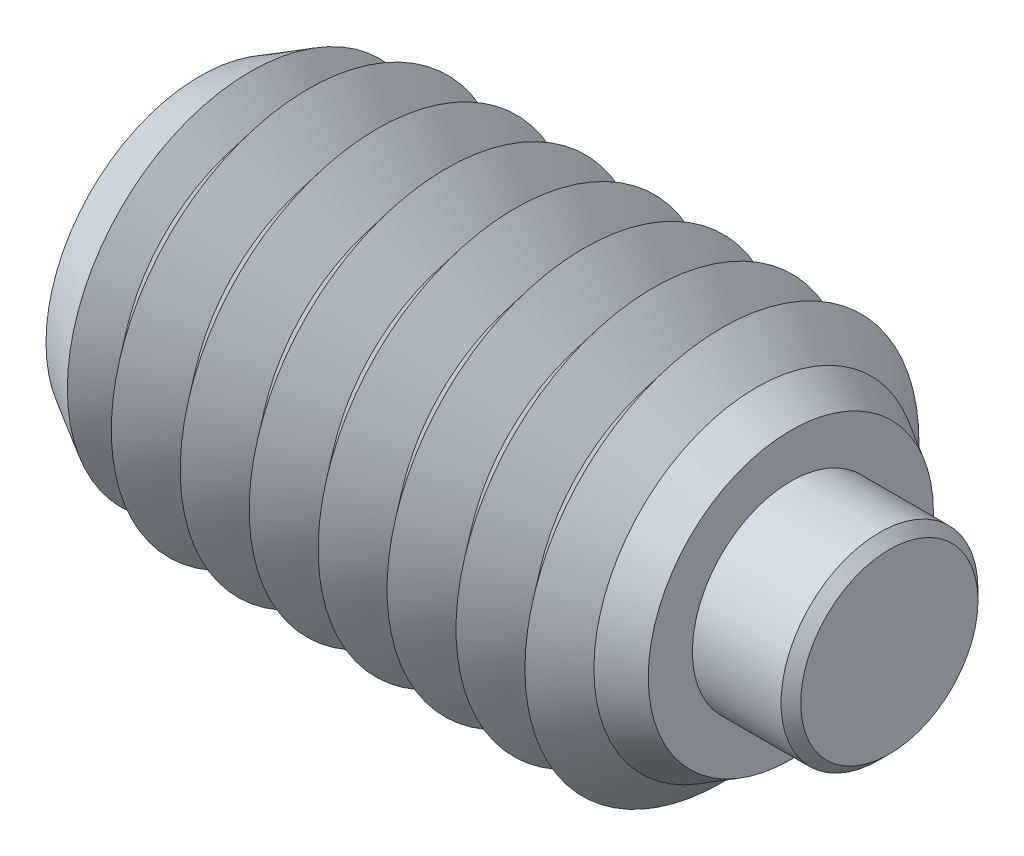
ISO-10303-21;
HEADER;
FILE_DESCRIPTION(('STEP AP214'),'2;1');
FILE_NAME('part.step','',(''),(''),'','','');
FILE_SCHEMA(('AUTOMOTIVE_DESIGN { 1 0 10303 214 1 1 1 1 }'));
ENDSEC;
DATA;
#1=APPLICATION_CONTEXT('core data for automotive mechanical design processes');
#2=APPLICATION_PROTOCOL_DEFINITION('international standard','automotive_design',2000,#1);
#3=PRODUCT_CONTEXT('',#1,'mechanical');
#4=PRODUCT('Part','Part','',(#3));
#5=PRODUCT_RELATED_PRODUCT_CATEGORY('part','',(#4));
#6=PRODUCT_DEFINITION_FORMATION('','',#4);
#7=PRODUCT_DEFINITION_CONTEXT('part definition',#1,'design');
#8=PRODUCT_DEFINITION('design','',#6,#7);
#9=PRODUCT_DEFINITION_SHAPE('','',#8);
#10=(LENGTH_UNIT() NAMED_UNIT(*) SI_UNIT(.MILLI.,.METRE.));
#11=(NAMED_UNIT(*) PLANE_ANGLE_UNIT() SI_UNIT($,.RADIAN.));
#12=(NAMED_UNIT(*) SI_UNIT($,.STERADIAN.) SOLID_ANGLE_UNIT());
#13=UNCERTAINTY_MEASURE_WITH_UNIT(LENGTH_MEASURE(1.E-05),#10,'distance_accuracy_value','');
#14=(GEOMETRIC_REPRESENTATION_CONTEXT(3) GLOBAL_UNCERTAINTY_ASSIGNED_CONTEXT((#13)) GLOBAL_UNIT_ASSIGNED_CONTEXT((#10,
#11,#12)) REPRESENTATION_CONTEXT('',''));
#15=CARTESIAN_POINT('',(0.,0.,0.));
#16=DIRECTION('',(0.,0.,1.));
#17=DIRECTION('',(1.,0.,0.));
#18=AXIS2_PLACEMENT_3D('',#15,#16,#17);
#19=CARTESIAN_POINT('',(1.35,0.,0.));
#20=DIRECTION('',(-1.,0.,0.));
#21=DIRECTION('',(0.,0.,1.));
#22=AXIS2_PLACEMENT_3D('',#19,#20,#21);
#23=CYLINDRICAL_SURFACE('',#22,1.);
#24=CARTESIAN_POINT('',(1.25,0.,0.));
#25=DIRECTION('',(1.,0.,0.));
#26=DIRECTION('',(0.,0.,-1.));
#27=AXIS2_PLACEMENT_3D('',#24,#25,#26);
#28=CIRCLE('',#27,1.);
#29=CARTESIAN_POINT('',(1.25,0.,-1.));
#30=VERTEX_POINT('',#29);
#31=EDGE_CURVE('P0_E10',#30,#30,#28,.F.);
#32=ORIENTED_EDGE('',*,*,#31,.T.);
#33=EDGE_LOOP('',(#32));
#34=FACE_BOUND('',#33,.T.);
#35=CARTESIAN_POINT('',(-0.65,0.,0.));
#36=DIRECTION('',(1.,0.,0.));
#37=DIRECTION('',(0.,0.,-1.));
#38=AXIS2_PLACEMENT_3D('',#35,#36,#37);
#39=CIRCLE('',#38,1.);
#40=CARTESIAN_POINT('',(-0.65,0.,-1.));
#41=VERTEX_POINT('',#40);
#42=EDGE_CURVE('P0_E25',#41,#41,#39,.T.);
#43=ORIENTED_EDGE('',*,*,#42,.T.);
#44=EDGE_LOOP('',(#43));
#45=FACE_BOUND('',#44,.T.);
#46=ADVANCED_FACE('P0_F14',(#34,#45),#23,.T.);
#47=CARTESIAN_POINT('',(1.35,0.,0.));
#48=DIRECTION('',(1.,0.,0.));
#49=DIRECTION('',(0.,0.,-1.));
#50=AXIS2_PLACEMENT_3D('',#47,#48,#49);
#51=PLANE('',#50);
#52=CARTESIAN_POINT('',(1.35,0.,0.));
#53=DIRECTION('',(1.,0.,0.));
#54=DIRECTION('',(0.,0.,-1.));
#55=AXIS2_PLACEMENT_3D('',#52,#53,#54);
#56=CIRCLE('',#55,0.899999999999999);
#57=CARTESIAN_POINT('',(1.35,0.,-0.899999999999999));
#58=VERTEX_POINT('',#57);
#59=EDGE_CURVE('P0_E21',#58,#58,#56,.T.);
#60=ORIENTED_EDGE('',*,*,#59,.T.);
#61=EDGE_LOOP('',(#60));
#62=FACE_BOUND('',#61,.T.);
#63=ADVANCED_FACE('P0_F35',(#62),#51,.T.);
#64=CARTESIAN_POINT('',(-0.65,0.,0.));
#65=DIRECTION('',(1.,0.,0.));
#66=DIRECTION('',(0.,0.,-1.));
#67=AXIS2_PLACEMENT_3D('',#64,#65,#66);
#68=PLANE('',#67);
#69=ORIENTED_EDGE('',*,*,#42,.F.);
#70=EDGE_LOOP('',(#69));
#71=FACE_BOUND('',#70,.T.);
#72=ADVANCED_FACE('P0_F33',(#71),#68,.F.);
#73=CARTESIAN_POINT('',(1.35,0.,0.));
#74=DIRECTION('',(-1.,0.,0.));
#75=DIRECTION('',(0.,0.,1.));
#76=AXIS2_PLACEMENT_3D('',#73,#74,#75);
#77=CONICAL_SURFACE('',#76,0.899999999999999,0.785398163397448);
#78=ORIENTED_EDGE('',*,*,#31,.F.);
#79=EDGE_LOOP('',(#78));
#80=FACE_BOUND('',#79,.T.);
#81=ORIENTED_EDGE('',*,*,#59,.F.);
#82=EDGE_LOOP('',(#81));
#83=FACE_BOUND('',#82,.T.);
#84=ADVANCED_FACE('P0_F16',(#80,#83),#77,.T.);
#85=CLOSED_SHELL('',(#46,#63,#72,#84));
#86=MANIFOLD_SOLID_BREP('P0_B1',#85);
#87=CARTESIAN_POINT('',(-5.25,0.,0.));
#88=DIRECTION('',(-1.,0.,0.));
#89=DIRECTION('',(0.,0.,1.));
#90=AXIS2_PLACEMENT_3D('',#87,#88,#89);
#91=CONICAL_SURFACE('',#90,2.,0.895664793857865);
#92=CARTESIAN_POINT('',(-4.9,0.,0.));
#93=DIRECTION('',(1.,0.,0.));
#94=DIRECTION('',(0.,0.,-1.));
#95=AXIS2_PLACEMENT_3D('',#92,#93,#94);
#96=CIRCLE('',#95,1.56285014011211);
#97=CARTESIAN_POINT('',(-4.9,0.,-1.56285014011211));
#98=VERTEX_POINT('',#97);
#99=EDGE_CURVE('P1_E671',#98,#98,#96,.T.);
#100=ORIENTED_EDGE('',*,*,#99,.F.);
#101=EDGE_LOOP('',(#100));
#102=FACE_BOUND('',#101,.T.);
#103=CARTESIAN_POINT('',(-5.13709186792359,0.,0.));
#104=DIRECTION('',(1.,0.,0.));
#105=DIRECTION('',(0.,0.,-1.));
#106=AXIS2_PLACEMENT_3D('',#103,#104,#105);
#107=CIRCLE('',#106,1.85897778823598);
#108=CARTESIAN_POINT('',(-5.13709186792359,0.,-1.85897778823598));
#109=VERTEX_POINT('',#108);
#110=EDGE_CURVE('P1_E674',#109,#109,#107,.F.);
#111=ORIENTED_EDGE('',*,*,#110,.F.);
#112=EDGE_LOOP('',(#111));
#113=FACE_BOUND('',#112,.T.);
#114=ADVANCED_FACE('P1_F15',(#102,#113),#91,.T.);
#115=CARTESIAN_POINT('',(-0.7,0.,0.));
#116=DIRECTION('',(1.,0.,0.));
#117=DIRECTION('',(0.,0.,-1.));
#118=AXIS2_PLACEMENT_3D('',#115,#116,#117);
#119=CONICAL_SURFACE('',#118,1.56285014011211,0.895664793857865);
#120=CARTESIAN_POINT('',(-0.35,0.,0.));
#121=DIRECTION('',(1.,0.,0.));
#122=DIRECTION('',(0.,0.,-1.));
#123=AXIS2_PLACEMENT_3D('',#120,#121,#122);
#124=CIRCLE('',#123,2.);
#125=CARTESIAN_POINT('',(-0.35,0.,2.));
#126=VERTEX_POINT('',#125);
#127=EDGE_CURVE('P1_E631',#126,#126,#124,.T.);
#128=ORIENTED_EDGE('',*,*,#127,.F.);
#129=EDGE_LOOP('',(#128));
#130=FACE_BOUND('',#129,.T.);
#131=CARTESIAN_POINT('',(-0.7,0.,0.));
#132=DIRECTION('',(1.,0.,0.));
#133=DIRECTION('',(0.,0.,-1.));
#134=AXIS2_PLACEMENT_3D('',#131,#132,#133);
#135=CIRCLE('',#134,1.56285014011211);
#136=CARTESIAN_POINT('',(-0.7,0.,-1.56285014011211));
#137=VERTEX_POINT('',#136);
#138=EDGE_CURVE('P1_E632',#137,#137,#135,.T.);
#139=ORIENTED_EDGE('',*,*,#138,.T.);
#140=EDGE_LOOP('',(#139));
#141=FACE_BOUND('',#140,.T.);
#142=ADVANCED_FACE('P1_F222',(#130,#141),#119,.T.);
#143=CARTESIAN_POINT('',(-1.05,0.,0.));
#144=DIRECTION('',(-1.,0.,0.));
#145=DIRECTION('',(0.,0.,1.));
#146=AXIS2_PLACEMENT_3D('',#143,#144,#145);
#147=CONICAL_SURFACE('',#146,2.,0.895664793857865);
#148=ORIENTED_EDGE('',*,*,#138,.F.);
#149=EDGE_LOOP('',(#148));
#150=FACE_BOUND('',#149,.T.);
#151=CARTESIAN_POINT('',(-1.05,0.,0.));
#152=DIRECTION('',(1.,0.,0.));
#153=DIRECTION('',(0.,0.,-1.));
#154=AXIS2_PLACEMENT_3D('',#151,#152,#153);
#155=CIRCLE('',#154,2.);
#156=CARTESIAN_POINT('',(-1.05,0.,-2.));
#157=VERTEX_POINT('',#156);
#158=EDGE_CURVE('P1_E636',#157,#157,#155,.T.);
#159=ORIENTED_EDGE('',*,*,#158,.T.);
#160=EDGE_LOOP('',(#159));
#161=FACE_BOUND('',#160,.T.);
#162=ADVANCED_FACE('P1_F227',(#150,#161),#147,.T.);
#163=CARTESIAN_POINT('',(-0.65,0.,0.));
#164=DIRECTION('',(1.,0.,0.));
#165=DIRECTION('',(0.,1.,0.));
#166=AXIS2_PLACEMENT_3D('',#163,#164,#165);
#167=PLANE('',#166);
#168=CARTESIAN_POINT('',(-0.65,0.,0.));
#169=DIRECTION('',(1.,0.,0.));
#170=DIRECTION('',(0.,1.,0.));
#171=AXIS2_PLACEMENT_3D('',#168,#169,#170);
#172=CIRCLE('',#171,1.);
#173=CARTESIAN_POINT('',(-0.65,1.,0.));
#174=VERTEX_POINT('',#173);
#175=EDGE_CURVE('P1_E350',#174,#174,#172,.T.);
#176=ORIENTED_EDGE('',*,*,#175,.T.);
#177=EDGE_LOOP('',(#176));
#178=FACE_BOUND('',#177,.T.);
#179=ADVANCED_FACE('P1_F277',(#178),#167,.T.);
#180=CARTESIAN_POINT('',(-0.65,0.,0.));
#181=DIRECTION('',(1.,0.,0.));
#182=DIRECTION('',(0.,1.,0.));
#183=AXIS2_PLACEMENT_3D('',#180,#181,#182);
#184=CYLINDRICAL_SURFACE('',#183,1.);
#185=ORIENTED_EDGE('',*,*,#175,.F.);
#186=EDGE_LOOP('',(#185));
#187=FACE_BOUND('',#186,.T.);
#188=CARTESIAN_POINT('',(0.35,0.,0.));
#189=DIRECTION('',(1.,0.,0.));
#190=DIRECTION('',(0.,1.,0.));
#191=AXIS2_PLACEMENT_3D('',#188,#189,#190);
#192=CIRCLE('',#191,1.);
#193=CARTESIAN_POINT('',(0.35,1.,0.));
#194=VERTEX_POINT('',#193);
#195=EDGE_CURVE('P1_E353',#194,#194,#192,.T.);
#196=ORIENTED_EDGE('',*,*,#195,.T.);
#197=EDGE_LOOP('',(#196));
#198=FACE_BOUND('',#197,.T.);
#199=ADVANCED_FACE('P1_F209',(#187,#198),#184,.F.);
#200=CARTESIAN_POINT('',(0.35,1.44792740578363,0.));
#201=DIRECTION('',(1.,0.,0.));
#202=DIRECTION('',(0.,1.,0.));
#203=AXIS2_PLACEMENT_3D('',#200,#201,#202);
#204=PLANE('',#203);
#205=ORIENTED_EDGE('',*,*,#195,.F.);
#206=EDGE_LOOP('',(#205));
#207=FACE_BOUND('',#206,.T.);
#208=CARTESIAN_POINT('',(0.35,0.,0.));
#209=DIRECTION('',(1.,0.,0.));
#210=DIRECTION('',(0.,1.,0.));
#211=AXIS2_PLACEMENT_3D('',#208,#209,#210);
#212=CIRCLE('',#211,1.44792740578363);
#213=CARTESIAN_POINT('',(0.35,1.44792740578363,0.));
#214=VERTEX_POINT('',#213);
#215=EDGE_CURVE('P1_E121',#214,#214,#212,.T.);
#216=ORIENTED_EDGE('',*,*,#215,.T.);
#217=EDGE_LOOP('',(#216));
#218=FACE_BOUND('',#217,.T.);
#219=ADVANCED_FACE('P1_F206',(#207,#218),#204,.T.);
#220=CARTESIAN_POINT('',(0.35,0.,0.));
#221=DIRECTION('',(-1.,0.,0.));
#222=DIRECTION('',(0.,-1.,0.));
#223=AXIS2_PLACEMENT_3D('',#220,#221,#222);
#224=CONICAL_SURFACE('',#223,1.44792740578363,0.523598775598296);
#225=CARTESIAN_POINT('',(0.,0.,0.));
#226=DIRECTION('',(1.,0.,0.));
#227=DIRECTION('',(0.,0.,-1.));
#228=AXIS2_PLACEMENT_3D('',#225,#226,#227);
#229=CIRCLE('',#228,1.65);
#230=CARTESIAN_POINT('',(0.,0.,1.65));
#231=VERTEX_POINT('',#230);
#232=EDGE_CURVE('P1_E341',#231,#231,#229,.T.);
#233=ORIENTED_EDGE('',*,*,#232,.T.);
#234=EDGE_LOOP('',(#233));
#235=FACE_BOUND('',#234,.T.);
#236=ORIENTED_EDGE('',*,*,#215,.F.);
#237=EDGE_LOOP('',(#236));
#238=FACE_BOUND('',#237,.T.);
#239=ADVANCED_FACE('P1_F203',(#235,#238),#224,.T.);
#240=CARTESIAN_POINT('',(0.,0.,0.));
#241=DIRECTION('',(-1.,0.,0.));
#242=DIRECTION('',(0.,0.,1.));
#243=AXIS2_PLACEMENT_3D('',#240,#241,#242);
#244=CONICAL_SURFACE('',#243,1.65,0.785398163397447);
#245=CARTESIAN_POINT('',(-0.35,0.,2.));
#246=CARTESIAN_POINT('',(-0.346354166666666,0.,1.99635416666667));
#247=CARTESIAN_POINT('',(-0.342708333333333,0.,1.99270833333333));
#248=CARTESIAN_POINT('',(-0.335416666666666,0.,1.98541666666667));
#249=CARTESIAN_POINT('',(-0.331770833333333,0.,1.98177083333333));
#250=CARTESIAN_POINT('',(-0.324479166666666,0.,1.97447916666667));
#251=CARTESIAN_POINT('',(-0.320833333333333,0.,1.97083333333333));
#252=CARTESIAN_POINT('',(-0.313541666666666,0.,1.96354166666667));
#253=CARTESIAN_POINT('',(-0.309895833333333,0.,1.95989583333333));
#254=CARTESIAN_POINT('',(-0.302604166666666,0.,1.95260416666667));
#255=CARTESIAN_POINT('',(-0.298958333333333,0.,1.94895833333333));
#256=CARTESIAN_POINT('',(-0.291666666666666,0.,1.94166666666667));
#257=CARTESIAN_POINT('',(-0.288020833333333,0.,1.93802083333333));
#258=CARTESIAN_POINT('',(-0.280729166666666,0.,1.93072916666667));
#259=CARTESIAN_POINT('',(-0.277083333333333,0.,1.92708333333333));
#260=CARTESIAN_POINT('',(-0.269791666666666,0.,1.91979166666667));
#261=CARTESIAN_POINT('',(-0.266145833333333,0.,1.91614583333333));
#262=CARTESIAN_POINT('',(-0.258854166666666,0.,1.90885416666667));
#263=CARTESIAN_POINT('',(-0.255208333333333,0.,1.90520833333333));
#264=CARTESIAN_POINT('',(-0.247916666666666,0.,1.89791666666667));
#265=CARTESIAN_POINT('',(-0.244270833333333,0.,1.89427083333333));
#266=CARTESIAN_POINT('',(-0.236979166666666,0.,1.88697916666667));
#267=CARTESIAN_POINT('',(-0.233333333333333,0.,1.88333333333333));
#268=CARTESIAN_POINT('',(-0.226041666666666,0.,1.87604166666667));
#269=CARTESIAN_POINT('',(-0.222395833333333,0.,1.87239583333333));
#270=CARTESIAN_POINT('',(-0.215104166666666,0.,1.86510416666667));
#271=CARTESIAN_POINT('',(-0.211458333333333,0.,1.86145833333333));
#272=CARTESIAN_POINT('',(-0.204166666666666,0.,1.85416666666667));
#273=CARTESIAN_POINT('',(-0.200520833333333,0.,1.85052083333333));
#274=CARTESIAN_POINT('',(-0.193229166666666,0.,1.84322916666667));
#275=CARTESIAN_POINT('',(-0.189583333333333,0.,1.83958333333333));
#276=CARTESIAN_POINT('',(-0.182291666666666,0.,1.83229166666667));
#277=CARTESIAN_POINT('',(-0.178645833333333,0.,1.82864583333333));
#278=CARTESIAN_POINT('',(-0.171354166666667,0.,1.82135416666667));
#279=CARTESIAN_POINT('',(-0.167708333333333,0.,1.81770833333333));
#280=CARTESIAN_POINT('',(-0.160416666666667,0.,1.81041666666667));
#281=CARTESIAN_POINT('',(-0.156770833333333,0.,1.80677083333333));
#282=CARTESIAN_POINT('',(-0.149479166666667,0.,1.79947916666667));
#283=CARTESIAN_POINT('',(-0.145833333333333,0.,1.79583333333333));
#284=CARTESIAN_POINT('',(-0.138541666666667,0.,1.78854166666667));
#285=CARTESIAN_POINT('',(-0.134895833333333,0.,1.78489583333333));
#286=CARTESIAN_POINT('',(-0.127604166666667,0.,1.77760416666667));
#287=CARTESIAN_POINT('',(-0.123958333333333,0.,1.77395833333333));
#288=CARTESIAN_POINT('',(-0.116666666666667,0.,1.76666666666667));
#289=CARTESIAN_POINT('',(-0.113020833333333,0.,1.76302083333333));
#290=CARTESIAN_POINT('',(-0.105729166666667,0.,1.75572916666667));
#291=CARTESIAN_POINT('',(-0.102083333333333,0.,1.75208333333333));
#292=CARTESIAN_POINT('',(-0.0947916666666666,0.,1.74479166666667));
#293=CARTESIAN_POINT('',(-0.0911458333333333,0.,1.74114583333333));
#294=CARTESIAN_POINT('',(-0.0838541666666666,0.,1.73385416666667));
#295=CARTESIAN_POINT('',(-0.0802083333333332,0.,1.73020833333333));
#296=CARTESIAN_POINT('',(-0.0729166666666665,0.,1.72291666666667));
#297=CARTESIAN_POINT('',(-0.0692708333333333,0.,1.71927083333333));
#298=CARTESIAN_POINT('',(-0.0619791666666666,0.,1.71197916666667));
#299=CARTESIAN_POINT('',(-0.0583333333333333,0.,1.70833333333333));
#300=CARTESIAN_POINT('',(-0.0510416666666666,0.,1.70104166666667));
#301=CARTESIAN_POINT('',(-0.0473958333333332,0.,1.69739583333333));
#302=CARTESIAN_POINT('',(-0.0401041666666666,0.,1.69010416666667));
#303=CARTESIAN_POINT('',(-0.0364583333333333,0.,1.68645833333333));
#304=CARTESIAN_POINT('',(-0.0291666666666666,0.,1.67916666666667));
#305=CARTESIAN_POINT('',(-0.0255208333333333,0.,1.67552083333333));
#306=CARTESIAN_POINT('',(-0.0182291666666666,0.,1.66822916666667));
#307=CARTESIAN_POINT('',(-0.0145833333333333,0.,1.66458333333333));
#308=CARTESIAN_POINT('',(-0.0072916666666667,0.,1.65729166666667));
#309=CARTESIAN_POINT('',(-0.0036458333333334,0.,1.65364583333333));
#310=CARTESIAN_POINT('',(0.,0.,1.65));
#311=B_SPLINE_CURVE_WITH_KNOTS('',3,(#245,#246,#247,#248,#249,#250,#251,#252,#253,#254,#255,
#256,#257,#258,#259,#260,#261,#262,#263,#264,#265,#266,#267,#268,#269,#270,#271,#272,#273,#274,
#275,#276,#277,#278,#279,#280,#281,#282,#283,#284,#285,#286,#287,#288,#289,#290,#291,#292,#293,
#294,#295,#296,#297,#298,#299,#300,#301,#302,#303,#304,#305,#306,#307,#308,#309,#310),
.UNSPECIFIED.,.F.,.F.,(4,2,2,2,2,2,2,2,2,2,2,2,2,2,2,2,2,2,2,2,2,2,2,2,2,2,2,2,2,2,2,2,4),(0.,
0.0154679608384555,0.0309359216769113,0.0464038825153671,0.0618718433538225,0.0773398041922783,
0.0928077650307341,0.10827572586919,0.123743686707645,0.139211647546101,0.154679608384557,
0.170147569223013,0.185615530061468,0.201083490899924,0.21655145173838,0.232019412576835,
0.247487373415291,0.262955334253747,0.278423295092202,0.293891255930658,0.309359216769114,
0.32482717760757,0.340295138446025,0.355763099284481,0.371231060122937,0.386699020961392,
0.402166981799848,0.417634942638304,0.433102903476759,0.448570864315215,0.464038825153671,
0.479506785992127,0.494974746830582),.UNSPECIFIED.);
#312=EDGE_CURVE('P1_BSEAM17',#126,#231,#311,.T.);
#313=ORIENTED_EDGE('',*,*,#127,.T.);
#314=ORIENTED_EDGE('',*,*,#232,.F.);
#315=ORIENTED_EDGE('',*,*,#312,.T.);
#316=ORIENTED_EDGE('',*,*,#312,.F.);
#317=EDGE_LOOP('',(#313,#315,#314,#316));
#318=FACE_BOUND('',#317,.T.);
#319=ADVANCED_FACE('P1_F17',(#318),#244,.T.);
#320=CARTESIAN_POINT('',(-1.4,0.,0.));
#321=DIRECTION('',(1.,0.,0.));
#322=DIRECTION('',(0.,0.,-1.));
#323=AXIS2_PLACEMENT_3D('',#320,#321,#322);
#324=CONICAL_SURFACE('',#323,1.56285014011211,0.895664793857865);
#325=ORIENTED_EDGE('',*,*,#158,.F.);
#326=EDGE_LOOP('',(#325));
#327=FACE_BOUND('',#326,.T.);
#328=CARTESIAN_POINT('',(-1.4,0.,0.));
#329=DIRECTION('',(1.,0.,0.));
#330=DIRECTION('',(0.,0.,-1.));
#331=AXIS2_PLACEMENT_3D('',#328,#329,#330);
#332=CIRCLE('',#331,1.56285014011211);
#333=CARTESIAN_POINT('',(-1.4,0.,-1.56285014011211));
#334=VERTEX_POINT('',#333);
#335=EDGE_CURVE('P1_E641',#334,#334,#332,.T.);
#336=ORIENTED_EDGE('',*,*,#335,.T.);
#337=EDGE_LOOP('',(#336));
#338=FACE_BOUND('',#337,.T.);
#339=ADVANCED_FACE('P1_F271',(#327,#338),#324,.T.);
#340=CARTESIAN_POINT('',(-1.75,0.,0.));
#341=DIRECTION('',(-1.,0.,0.));
#342=DIRECTION('',(0.,0.,1.));
#343=AXIS2_PLACEMENT_3D('',#340,#341,#342);
#344=CONICAL_SURFACE('',#343,2.,0.895664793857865);
#345=ORIENTED_EDGE('',*,*,#335,.F.);
#346=EDGE_LOOP('',(#345));
#347=FACE_BOUND('',#346,.T.);
#348=CARTESIAN_POINT('',(-1.75,0.,0.));
#349=DIRECTION('',(1.,0.,0.));
#350=DIRECTION('',(0.,0.,-1.));
#351=AXIS2_PLACEMENT_3D('',#348,#349,#350);
#352=CIRCLE('',#351,2.);
#353=CARTESIAN_POINT('',(-1.75,0.,-2.));
#354=VERTEX_POINT('',#353);
#355=EDGE_CURVE('P1_E644',#354,#354,#352,.T.);
#356=ORIENTED_EDGE('',*,*,#355,.T.);
#357=EDGE_LOOP('',(#356));
#358=FACE_BOUND('',#357,.T.);
#359=ADVANCED_FACE('P1_F267',(#347,#358),#344,.T.);
#360=CARTESIAN_POINT('',(-2.1,0.,0.));
#361=DIRECTION('',(1.,0.,0.));
#362=DIRECTION('',(0.,0.,-1.));
#363=AXIS2_PLACEMENT_3D('',#360,#361,#362);
#364=CONICAL_SURFACE('',#363,1.56285014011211,0.895664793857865);
#365=ORIENTED_EDGE('',*,*,#355,.F.);
#366=EDGE_LOOP('',(#365));
#367=FACE_BOUND('',#366,.T.);
#368=CARTESIAN_POINT('',(-2.1,0.,0.));
#369=DIRECTION('',(1.,0.,0.));
#370=DIRECTION('',(0.,0.,-1.));
#371=AXIS2_PLACEMENT_3D('',#368,#369,#370);
#372=CIRCLE('',#371,1.56285014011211);
#373=CARTESIAN_POINT('',(-2.1,0.,-1.56285014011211));
#374=VERTEX_POINT('',#373);
#375=EDGE_CURVE('P1_E647',#374,#374,#372,.T.);
#376=ORIENTED_EDGE('',*,*,#375,.T.);
#377=EDGE_LOOP('',(#376));
#378=FACE_BOUND('',#377,.T.);
#379=ADVANCED_FACE('P1_F263',(#367,#378),#364,.T.);
#380=CARTESIAN_POINT('',(-2.45,0.,0.));
#381=DIRECTION('',(-1.,0.,0.));
#382=DIRECTION('',(0.,0.,1.));
#383=AXIS2_PLACEMENT_3D('',#380,#381,#382);
#384=CONICAL_SURFACE('',#383,2.,0.895664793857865);
#385=ORIENTED_EDGE('',*,*,#375,.F.);
#386=EDGE_LOOP('',(#385));
#387=FACE_BOUND('',#386,.T.);
#388=CARTESIAN_POINT('',(-2.45,0.,0.));
#389=DIRECTION('',(1.,0.,0.));
#390=DIRECTION('',(0.,0.,-1.));
#391=AXIS2_PLACEMENT_3D('',#388,#389,#390);
#392=CIRCLE('',#391,2.);
#393=CARTESIAN_POINT('',(-2.45,0.,-2.));
#394=VERTEX_POINT('',#393);
#395=EDGE_CURVE('P1_E650',#394,#394,#392,.T.);
#396=ORIENTED_EDGE('',*,*,#395,.T.);
#397=EDGE_LOOP('',(#396));
#398=FACE_BOUND('',#397,.T.);
#399=ADVANCED_FACE('P1_F259',(#387,#398),#384,.T.);
#400=CARTESIAN_POINT('',(-2.8,0.,0.));
#401=DIRECTION('',(1.,0.,0.));
#402=DIRECTION('',(0.,0.,-1.));
#403=AXIS2_PLACEMENT_3D('',#400,#401,#402);
#404=CONICAL_SURFACE('',#403,1.56285014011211,0.895664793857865);
#405=ORIENTED_EDGE('',*,*,#395,.F.);
#406=EDGE_LOOP('',(#405));
#407=FACE_BOUND('',#406,.T.);
#408=CARTESIAN_POINT('',(-2.8,0.,0.));
#409=DIRECTION('',(1.,0.,0.));
#410=DIRECTION('',(0.,0.,-1.));
#411=AXIS2_PLACEMENT_3D('',#408,#409,#410);
#412=CIRCLE('',#411,1.56285014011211);
#413=CARTESIAN_POINT('',(-2.8,0.,-1.56285014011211));
#414=VERTEX_POINT('',#413);
#415=EDGE_CURVE('P1_E653',#414,#414,#412,.T.);
#416=ORIENTED_EDGE('',*,*,#415,.T.);
#417=EDGE_LOOP('',(#416));
#418=FACE_BOUND('',#417,.T.);
#419=ADVANCED_FACE('P1_F255',(#407,#418),#404,.T.);
#420=CARTESIAN_POINT('',(-3.15,0.,0.));
#421=DIRECTION('',(-1.,0.,0.));
#422=DIRECTION('',(0.,0.,1.));
#423=AXIS2_PLACEMENT_3D('',#420,#421,#422);
#424=CONICAL_SURFACE('',#423,2.,0.895664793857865);
#425=ORIENTED_EDGE('',*,*,#415,.F.);
#426=EDGE_LOOP('',(#425));
#427=FACE_BOUND('',#426,.T.);
#428=CARTESIAN_POINT('',(-3.15,0.,0.));
#429=DIRECTION('',(1.,0.,0.));
#430=DIRECTION('',(0.,0.,-1.));
#431=AXIS2_PLACEMENT_3D('',#428,#429,#430);
#432=CIRCLE('',#431,2.);
#433=CARTESIAN_POINT('',(-3.15,0.,-2.));
#434=VERTEX_POINT('',#433);
#435=EDGE_CURVE('P1_E656',#434,#434,#432,.T.);
#436=ORIENTED_EDGE('',*,*,#435,.T.);
#437=EDGE_LOOP('',(#436));
#438=FACE_BOUND('',#437,.T.);
#439=ADVANCED_FACE('P1_F251',(#427,#438),#424,.T.);
#440=CARTESIAN_POINT('',(-3.5,0.,0.));
#441=DIRECTION('',(1.,0.,0.));
#442=DIRECTION('',(0.,0.,-1.));
#443=AXIS2_PLACEMENT_3D('',#440,#441,#442);
#444=CONICAL_SURFACE('',#443,1.56285014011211,0.895664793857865);
#445=ORIENTED_EDGE('',*,*,#435,.F.);
#446=EDGE_LOOP('',(#445));
#447=FACE_BOUND('',#446,.T.);
#448=CARTESIAN_POINT('',(-3.5,0.,0.));
#449=DIRECTION('',(1.,0.,0.));
#450=DIRECTION('',(0.,0.,-1.));
#451=AXIS2_PLACEMENT_3D('',#448,#449,#450);
#452=CIRCLE('',#451,1.56285014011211);
#453=CARTESIAN_POINT('',(-3.5,0.,-1.56285014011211));
#454=VERTEX_POINT('',#453);
#455=EDGE_CURVE('P1_E659',#454,#454,#452,.T.);
#456=ORIENTED_EDGE('',*,*,#455,.T.);
#457=EDGE_LOOP('',(#456));
#458=FACE_BOUND('',#457,.T.);
#459=ADVANCED_FACE('P1_F247',(#447,#458),#444,.T.);
#460=CARTESIAN_POINT('',(-3.85,0.,0.));
#461=DIRECTION('',(-1.,0.,0.));
#462=DIRECTION('',(0.,0.,1.));
#463=AXIS2_PLACEMENT_3D('',#460,#461,#462);
#464=CONICAL_SURFACE('',#463,2.,0.895664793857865);
#465=ORIENTED_EDGE('',*,*,#455,.F.);
#466=EDGE_LOOP('',(#465));
#467=FACE_BOUND('',#466,.T.);
#468=CARTESIAN_POINT('',(-3.85,0.,0.));
#469=DIRECTION('',(1.,0.,0.));
#470=DIRECTION('',(0.,0.,-1.));
#471=AXIS2_PLACEMENT_3D('',#468,#469,#470);
#472=CIRCLE('',#471,2.);
#473=CARTESIAN_POINT('',(-3.85,0.,-2.));
#474=VERTEX_POINT('',#473);
#475=EDGE_CURVE('P1_E662',#474,#474,#472,.T.);
#476=ORIENTED_EDGE('',*,*,#475,.T.);
#477=EDGE_LOOP('',(#476));
#478=FACE_BOUND('',#477,.T.);
#479=ADVANCED_FACE('P1_F243',(#467,#478),#464,.T.);
#480=CARTESIAN_POINT('',(-4.2,0.,0.));
#481=DIRECTION('',(1.,0.,0.));
#482=DIRECTION('',(0.,0.,-1.));
#483=AXIS2_PLACEMENT_3D('',#480,#481,#482);
#484=CONICAL_SURFACE('',#483,1.56285014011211,0.895664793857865);
#485=ORIENTED_EDGE('',*,*,#475,.F.);
#486=EDGE_LOOP('',(#485));
#487=FACE_BOUND('',#486,.T.);
#488=CARTESIAN_POINT('',(-4.2,0.,0.));
#489=DIRECTION('',(1.,0.,0.));
#490=DIRECTION('',(0.,0.,-1.));
#491=AXIS2_PLACEMENT_3D('',#488,#489,#490);
#492=CIRCLE('',#491,1.56285014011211);
#493=CARTESIAN_POINT('',(-4.2,0.,-1.56285014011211));
#494=VERTEX_POINT('',#493);
#495=EDGE_CURVE('P1_E665',#494,#494,#492,.T.);
#496=ORIENTED_EDGE('',*,*,#495,.T.);
#497=EDGE_LOOP('',(#496));
#498=FACE_BOUND('',#497,.T.);
#499=ADVANCED_FACE('P1_F239',(#487,#498),#484,.T.);
#500=CARTESIAN_POINT('',(-4.55,0.,0.));
#501=DIRECTION('',(-1.,0.,0.));
#502=DIRECTION('',(0.,0.,1.));
#503=AXIS2_PLACEMENT_3D('',#500,#501,#502);
#504=CONICAL_SURFACE('',#503,2.,0.895664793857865);
#505=ORIENTED_EDGE('',*,*,#495,.F.);
#506=EDGE_LOOP('',(#505));
#507=FACE_BOUND('',#506,.T.);
#508=CARTESIAN_POINT('',(-4.55,0.,0.));
#509=DIRECTION('',(1.,0.,0.));
#510=DIRECTION('',(0.,0.,-1.));
#511=AXIS2_PLACEMENT_3D('',#508,#509,#510);
#512=CIRCLE('',#511,2.);
#513=CARTESIAN_POINT('',(-4.55,0.,-2.));
#514=VERTEX_POINT('',#513);
#515=EDGE_CURVE('P1_E668',#514,#514,#512,.T.);
#516=ORIENTED_EDGE('',*,*,#515,.T.);
#517=EDGE_LOOP('',(#516));
#518=FACE_BOUND('',#517,.T.);
#519=ADVANCED_FACE('P1_F235',(#507,#518),#504,.T.);
#520=CARTESIAN_POINT('',(-4.9,0.,0.));
#521=DIRECTION('',(1.,0.,0.));
#522=DIRECTION('',(0.,0.,-1.));
#523=AXIS2_PLACEMENT_3D('',#520,#521,#522);
#524=CONICAL_SURFACE('',#523,1.56285014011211,0.895664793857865);
#525=ORIENTED_EDGE('',*,*,#515,.F.);
#526=EDGE_LOOP('',(#525));
#527=FACE_BOUND('',#526,.T.);
#528=ORIENTED_EDGE('',*,*,#99,.T.);
#529=EDGE_LOOP('',(#528));
#530=FACE_BOUND('',#529,.T.);
#531=ADVANCED_FACE('P1_F219',(#527,#530),#524,.T.);
#532=CARTESIAN_POINT('',(-5.65,0.,0.));
#533=DIRECTION('',(1.,0.,0.));
#534=DIRECTION('',(0.,0.,1.));
#535=AXIS2_PLACEMENT_3D('',#532,#533,#534);
#536=CONICAL_SURFACE('',#535,1.56285014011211,0.5235987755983);
#537=CARTESIAN_POINT('',(-5.65,0.,0.));
#538=DIRECTION('',(-1.,0.,0.));
#539=DIRECTION('',(0.,0.,1.));
#540=AXIS2_PLACEMENT_3D('',#537,#538,#539);
#541=CIRCLE('',#540,1.56285014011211);
#542=CARTESIAN_POINT('',(-5.65,0.,1.56285014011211));
#543=VERTEX_POINT('',#542);
#544=EDGE_CURVE('P1_E676',#543,#543,#541,.T.);
#545=ORIENTED_EDGE('',*,*,#544,.F.);
#546=EDGE_LOOP('',(#545));
#547=FACE_BOUND('',#546,.T.);
#548=ORIENTED_EDGE('',*,*,#110,.T.);
#549=EDGE_LOOP('',(#548));
#550=FACE_BOUND('',#549,.T.);
#551=ADVANCED_FACE('P1_F159',(#547,#550),#536,.T.);
#552=CARTESIAN_POINT('',(-5.65,0.,0.));
#553=DIRECTION('',(1.,0.,0.));
#554=DIRECTION('',(0.,0.,-1.));
#555=AXIS2_PLACEMENT_3D('',#552,#553,#554);
#556=PLANE('',#555);
#557=CARTESIAN_POINT('',(-5.65,0.,0.));
#558=DIRECTION('',(1.,0.,0.));
#559=DIRECTION('',(0.,0.,-1.));
#560=AXIS2_PLACEMENT_3D('',#557,#558,#559);
#561=CIRCLE('',#560,1.15470053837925);
#562=CARTESIAN_POINT('',(-5.65,-1.,-0.577350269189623));
#563=VERTEX_POINT('',#562);
#564=CARTESIAN_POINT('',(-5.65,0.,-1.15470053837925));
#565=VERTEX_POINT('',#564);
#566=EDGE_CURVE('P1_E19',#563,#565,#561,.T.);
#567=ORIENTED_EDGE('',*,*,#566,.T.);
#568=CARTESIAN_POINT('',(-5.65,1.,-0.577350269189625));
#569=VERTEX_POINT('',#568);
#570=EDGE_CURVE('P1_E10',#565,#569,#561,.T.);
#571=ORIENTED_EDGE('',*,*,#570,.T.);
#572=CARTESIAN_POINT('',(-5.65,0.999999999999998,0.577350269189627));
#573=VERTEX_POINT('',#572);
#574=EDGE_CURVE('P1_E24',#569,#573,#561,.T.);
#575=ORIENTED_EDGE('',*,*,#574,.T.);
#576=CARTESIAN_POINT('',(-5.65,0.,0.));
#577=DIRECTION('',(-1.,0.,0.));
#578=DIRECTION('',(0.,0.,1.));
#579=AXIS2_PLACEMENT_3D('',#576,#577,#578);
#580=CIRCLE('',#579,1.15470053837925);
#581=CARTESIAN_POINT('',(-5.65,0.,1.15470053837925));
#582=VERTEX_POINT('',#581);
#583=EDGE_CURVE('P1_E92',#582,#573,#580,.T.);
#584=ORIENTED_EDGE('',*,*,#583,.F.);
#585=CARTESIAN_POINT('',(-5.65,-1.,0.577350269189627));
#586=VERTEX_POINT('',#585);
#587=EDGE_CURVE('P1_E101',#582,#586,#561,.T.);
#588=ORIENTED_EDGE('',*,*,#587,.T.);
#589=EDGE_CURVE('P1_E107',#586,#563,#561,.T.);
#590=ORIENTED_EDGE('',*,*,#589,.T.);
#591=EDGE_LOOP('',(#567,#571,#575,#584,#588,#590));
#592=FACE_BOUND('',#591,.T.);
#593=ORIENTED_EDGE('',*,*,#544,.T.);
#594=EDGE_LOOP('',(#593));
#595=FACE_BOUND('',#594,.T.);
#596=ADVANCED_FACE('P1_F108',(#592,#595),#556,.F.);
#597=CARTESIAN_POINT('',(-5.65,0.,0.));
#598=DIRECTION('',(-1.,0.,0.));
#599=DIRECTION('',(0.,0.,1.));
#600=AXIS2_PLACEMENT_3D('',#597,#598,#599);
#601=CONICAL_SURFACE('',#600,1.15470053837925,1.0471975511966);
#602=ORIENTED_EDGE('',*,*,#566,.F.);
#603=CARTESIAN_POINT('',(-5.65006667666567,0.000199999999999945,-1.15481600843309));
#604=CARTESIAN_POINT('',(-5.63540897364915,-0.04374731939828,-1.12944301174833));
#605=CARTESIAN_POINT('',(-5.62207772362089,-0.0880739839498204,-1.10385100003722));
#606=CARTESIAN_POINT('',(-5.59880650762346,-0.177495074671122,-1.05222370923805));
#607=CARTESIAN_POINT('',(-5.58887477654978,-0.222591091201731,-1.02618751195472));
#608=CARTESIAN_POINT('',(-5.57341269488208,-0.312224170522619,-0.97443782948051));
#609=CARTESIAN_POINT('',(-5.56777946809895,-0.356747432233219,-0.948732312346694));
#610=CARTESIAN_POINT('',(-5.56105128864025,-0.446003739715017,-0.897200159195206));
#611=CARTESIAN_POINT('',(-5.55995076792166,-0.490736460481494,-0.871373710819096));
#612=CARTESIAN_POINT('',(-5.56222505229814,-0.574341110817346,-0.823104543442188));
#613=CARTESIAN_POINT('',(-5.56504143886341,-0.613225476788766,-0.80065464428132));
#614=CARTESIAN_POINT('',(-5.57397245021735,-0.690740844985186,-0.755901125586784));
#615=CARTESIAN_POINT('',(-5.5800901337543,-0.729371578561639,-0.733597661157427));
#616=CARTESIAN_POINT('',(-5.59538572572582,-0.807047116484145,-0.688751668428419));
#617=CARTESIAN_POINT('',(-5.60462855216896,-0.846082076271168,-0.666214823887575));
#618=CARTESIAN_POINT('',(-5.62560684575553,-0.923569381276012,-0.62147750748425));
#619=CARTESIAN_POINT('',(-5.63733737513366,-0.962022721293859,-0.599276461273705));
#620=CARTESIAN_POINT('',(-5.65006667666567,-1.0002,-0.577234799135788));
#621=B_SPLINE_CURVE_WITH_KNOTS('',3,(#603,#604,#605,#606,#607,#608,#609,#610,#611,#612,#613,
#614,#615,#616,#617,#618,#619,#620),.UNSPECIFIED.,.F.,.F.,(4,2,2,2,2,2,2,2,4),(0.,
0.158523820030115,0.317428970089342,0.472400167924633,0.627180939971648,0.762016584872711,
0.896977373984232,1.03493410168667,1.17261952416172),.UNSPECIFIED.);
#622=EDGE_CURVE('P1_E130',#565,#563,#621,.T.);
#623=ORIENTED_EDGE('',*,*,#622,.F.);
#624=EDGE_LOOP('',(#602,#623));
#625=FACE_BOUND('',#624,.T.);
#626=ADVANCED_FACE('P1_F158',(#625),#601,.F.);
#627=ORIENTED_EDGE('',*,*,#589,.F.);
#628=CARTESIAN_POINT('',(-6.02183528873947,-1.,-1.49514512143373));
#629=CARTESIAN_POINT('',(-6.00111502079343,-1.,-1.4519612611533));
#630=CARTESIAN_POINT('',(-5.98061367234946,-1.,-1.40867282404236));
#631=CARTESIAN_POINT('',(-5.9401634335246,-1.,-1.32182947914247));
#632=CARTESIAN_POINT('',(-5.92021464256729,-1.,-1.27827452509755));
#633=CARTESIAN_POINT('',(-5.86114515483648,-1.,-1.14662339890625));
#634=CARTESIAN_POINT('',(-5.82305252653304,-1.,-1.05805724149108));
#635=CARTESIAN_POINT('',(-5.75024582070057,-1.,-0.876833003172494));
#636=CARTESIAN_POINT('',(-5.71564584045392,-1.,-0.784128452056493));
#637=CARTESIAN_POINT('',(-5.65407347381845,-1.,-0.596331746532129));
#638=CARTESIAN_POINT('',(-5.62708128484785,-1.,-0.501246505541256));
#639=CARTESIAN_POINT('',(-5.59577577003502,-1.,-0.356699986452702));
#640=CARTESIAN_POINT('',(-5.58687509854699,-1.,-0.308244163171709));
#641=CARTESIAN_POINT('',(-5.57274243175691,-1.,-0.210788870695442));
#642=CARTESIAN_POINT('',(-5.56751018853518,-1.,-0.161789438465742));
#643=CARTESIAN_POINT('',(-5.56119898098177,-1.,-0.0641060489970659));
#644=CARTESIAN_POINT('',(-5.56007100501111,-1.,-0.0154253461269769));
#645=CARTESIAN_POINT('',(-5.56193297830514,-1.,0.0818553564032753));
#646=CARTESIAN_POINT('',(-5.56492318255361,-1.,0.130455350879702));
#647=CARTESIAN_POINT('',(-5.5771183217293,-1.,0.250369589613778));
#648=CARTESIAN_POINT('',(-5.58860856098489,-1.,0.321451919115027));
#649=CARTESIAN_POINT('',(-5.61824031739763,-1.,0.462229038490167));
#650=CARTESIAN_POINT('',(-5.63638985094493,-1.,0.531922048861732));
#651=CARTESIAN_POINT('',(-5.67786972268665,-1.,0.671415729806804));
#652=CARTESIAN_POINT('',(-5.70130716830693,-1.,0.741183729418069));
#653=CARTESIAN_POINT('',(-5.75156448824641,-1.,0.879438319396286));
#654=CARTESIAN_POINT('',(-5.77838317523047,-1.,0.947925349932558));
#655=CARTESIAN_POINT('',(-5.85005391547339,-1.,1.12214515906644));
#656=CARTESIAN_POINT('',(-5.89657230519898,-1.,1.22718574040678));
#657=CARTESIAN_POINT('',(-5.99287692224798,-1.,1.43575968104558));
#658=CARTESIAN_POINT('',(-6.04266398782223,-1.,1.53929264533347));
#659=CARTESIAN_POINT('',(-6.14433644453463,-1.,1.74546702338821));
#660=CARTESIAN_POINT('',(-6.19622418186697,-1.,1.84810727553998));
#661=CARTESIAN_POINT('',(-6.30133836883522,-1.,2.05270058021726));
#662=CARTESIAN_POINT('',(-6.35456486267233,-1.,2.15465360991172));
#663=CARTESIAN_POINT('',(-6.4568669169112,-1.,2.34846553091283));
#664=CARTESIAN_POINT('',(-6.50585965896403,-1.,2.44036823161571));
#665=CARTESIAN_POINT('',(-6.60440313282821,-1.,2.623877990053));
#666=CARTESIAN_POINT('',(-6.65395388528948,-1.,2.71548503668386));
#667=CARTESIAN_POINT('',(-6.75334710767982,-1.,2.89823865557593));
#668=CARTESIAN_POINT('',(-6.80318851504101,-1.,2.98938580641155));
#669=CARTESIAN_POINT('',(-6.90319572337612,-1.,3.17149583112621));
#670=CARTESIAN_POINT('',(-6.95336150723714,-1.,3.26245871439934));
#671=CARTESIAN_POINT('',(-7.00364621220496,-1.,3.35335539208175));
#672=B_SPLINE_CURVE_WITH_KNOTS('',3,(#628,#629,#630,#631,#632,#633,#634,#635,#636,#637,#638,
#639,#640,#641,#642,#643,#644,#645,#646,#647,#648,#649,#650,#651,#652,#653,#654,#655,#656,#657,
#658,#659,#660,#661,#662,#663,#664,#665,#666,#667,#668,#669,#670,#671),.UNSPECIFIED.,.F.,.F.,(4,
2,2,2,2,2,2,2,2,2,2,2,2,2,2,2,2,2,2,2,2,4),(0.,0.143690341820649,0.287406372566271,
0.57656033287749,0.873259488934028,1.16917907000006,1.31686338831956,1.46453772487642,
1.61044269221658,1.75635669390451,1.97192533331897,2.18775432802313,2.40842600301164,
2.62902040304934,2.97355048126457,3.31816926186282,3.6631841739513,4.00821049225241,
4.32064609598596,4.63309330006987,4.9447457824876,5.2563819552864),.UNSPECIFIED.);
#673=EDGE_CURVE('P1_E128',#563,#586,#672,.T.);
#674=ORIENTED_EDGE('',*,*,#673,.F.);
#675=EDGE_LOOP('',(#627,#674));
#676=FACE_BOUND('',#675,.T.);
#677=ADVANCED_FACE('P1_F217',(#676),#601,.F.);
#678=ORIENTED_EDGE('',*,*,#587,.F.);
#679=CARTESIAN_POINT('',(-5.65006667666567,-1.0002,0.577234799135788));
#680=CARTESIAN_POINT('',(-5.63540897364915,-0.95625268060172,0.602607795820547));
#681=CARTESIAN_POINT('',(-5.6220777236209,-0.91192601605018,0.628199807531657));
#682=CARTESIAN_POINT('',(-5.59880650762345,-0.822504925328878,0.679827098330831));
#683=CARTESIAN_POINT('',(-5.58887477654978,-0.777408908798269,0.705863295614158));
#684=CARTESIAN_POINT('',(-5.57341269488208,-0.687775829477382,0.757612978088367));
#685=CARTESIAN_POINT('',(-5.56777946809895,-0.643252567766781,0.783318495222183));
#686=CARTESIAN_POINT('',(-5.56105128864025,-0.553996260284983,0.834850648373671));
#687=CARTESIAN_POINT('',(-5.55995076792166,-0.509263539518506,0.860677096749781));
#688=CARTESIAN_POINT('',(-5.56222505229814,-0.425658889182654,0.908946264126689));
#689=CARTESIAN_POINT('',(-5.56504143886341,-0.386774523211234,0.931396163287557));
#690=CARTESIAN_POINT('',(-5.57397245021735,-0.309259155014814,0.976149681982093));
#691=CARTESIAN_POINT('',(-5.5800901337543,-0.270628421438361,0.998453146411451));
#692=CARTESIAN_POINT('',(-5.59538572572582,-0.192952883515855,1.04329913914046));
#693=CARTESIAN_POINT('',(-5.60462855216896,-0.153917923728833,1.0658359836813));
#694=CARTESIAN_POINT('',(-5.62560684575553,-0.076430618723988,1.11057330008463));
#695=CARTESIAN_POINT('',(-5.63733737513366,-0.0379772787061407,1.13277434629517));
#696=CARTESIAN_POINT('',(-5.65006667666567,0.000200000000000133,1.15481600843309));
#697=B_SPLINE_CURVE_WITH_KNOTS('',3,(#679,#680,#681,#682,#683,#684,#685,#686,#687,#688,#689,
#690,#691,#692,#693,#694,#695,#696),.UNSPECIFIED.,.F.,.F.,(4,2,2,2,2,2,2,2,4),(0.,
0.158523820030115,0.317428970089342,0.472400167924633,0.627180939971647,0.76201658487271,
0.896977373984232,1.03493410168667,1.17261952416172),.UNSPECIFIED.);
#698=EDGE_CURVE('P1_E96',#586,#582,#697,.T.);
#699=ORIENTED_EDGE('',*,*,#698,.F.);
#700=EDGE_LOOP('',(#678,#699));
#701=FACE_BOUND('',#700,.T.);
#702=ADVANCED_FACE('P1_F102',(#701),#601,.F.);
#703=ORIENTED_EDGE('',*,*,#583,.T.);
#704=CARTESIAN_POINT('',(-5.65006667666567,-0.000200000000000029,1.15481600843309));
#705=CARTESIAN_POINT('',(-5.63540897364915,0.0437473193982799,1.12944301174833));
#706=CARTESIAN_POINT('',(-5.6220777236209,0.0880739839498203,1.10385100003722));
#707=CARTESIAN_POINT('',(-5.59880650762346,0.177495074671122,1.05222370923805));
#708=CARTESIAN_POINT('',(-5.58887477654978,0.222591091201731,1.02618751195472));
#709=CARTESIAN_POINT('',(-5.57341269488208,0.312224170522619,0.97443782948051));
#710=CARTESIAN_POINT('',(-5.56777946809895,0.356747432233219,0.948732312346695));
#711=CARTESIAN_POINT('',(-5.56105128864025,0.446003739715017,0.897200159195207));
#712=CARTESIAN_POINT('',(-5.55995076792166,0.490736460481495,0.871373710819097));
#713=CARTESIAN_POINT('',(-5.56222505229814,0.574341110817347,0.823104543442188));
#714=CARTESIAN_POINT('',(-5.56504143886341,0.613225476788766,0.800654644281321));
#715=CARTESIAN_POINT('',(-5.57397245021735,0.690740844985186,0.755901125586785));
#716=CARTESIAN_POINT('',(-5.5800901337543,0.729371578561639,0.733597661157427));
#717=CARTESIAN_POINT('',(-5.59538572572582,0.807047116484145,0.688751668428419));
#718=CARTESIAN_POINT('',(-5.60462855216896,0.846082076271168,0.666214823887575));
#719=CARTESIAN_POINT('',(-5.62560684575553,0.923569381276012,0.62147750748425));
#720=CARTESIAN_POINT('',(-5.63733737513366,0.962022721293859,0.599276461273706));
#721=CARTESIAN_POINT('',(-5.65006667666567,1.0002,0.577234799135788));
#722=B_SPLINE_CURVE_WITH_KNOTS('',3,(#704,#705,#706,#707,#708,#709,#710,#711,#712,#713,#714,
#715,#716,#717,#718,#719,#720,#721),.UNSPECIFIED.,.F.,.F.,(4,2,2,2,2,2,2,2,4),(0.,
0.158523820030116,0.317428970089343,0.472400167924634,0.627180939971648,0.762016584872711,
0.896977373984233,1.03493410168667,1.17261952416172),.UNSPECIFIED.);
#723=EDGE_CURVE('P1_E88',#582,#573,#722,.T.);
#724=ORIENTED_EDGE('',*,*,#723,.F.);
#725=EDGE_LOOP('',(#703,#724));
#726=FACE_BOUND('',#725,.T.);
#727=ADVANCED_FACE('P1_F90',(#726),#601,.F.);
#728=ORIENTED_EDGE('',*,*,#574,.F.);
#729=CARTESIAN_POINT('',(-6.02183528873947,1.,-1.49514512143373));
#730=CARTESIAN_POINT('',(-6.00111502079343,1.,-1.4519612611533));
#731=CARTESIAN_POINT('',(-5.98061367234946,1.,-1.40867282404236));
#732=CARTESIAN_POINT('',(-5.9401634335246,1.,-1.32182947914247));
#733=CARTESIAN_POINT('',(-5.92021464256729,1.,-1.27827452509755));
#734=CARTESIAN_POINT('',(-5.86114515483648,1.,-1.14662339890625));
#735=CARTESIAN_POINT('',(-5.82305252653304,1.,-1.05805724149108));
#736=CARTESIAN_POINT('',(-5.75024582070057,1.,-0.876833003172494));
#737=CARTESIAN_POINT('',(-5.71564584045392,1.,-0.784128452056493));
#738=CARTESIAN_POINT('',(-5.65407347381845,1.,-0.596331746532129));
#739=CARTESIAN_POINT('',(-5.62708128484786,1.,-0.501246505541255));
#740=CARTESIAN_POINT('',(-5.59577577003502,1.,-0.356699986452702));
#741=CARTESIAN_POINT('',(-5.58687509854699,1.,-0.308244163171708));
#742=CARTESIAN_POINT('',(-5.57274243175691,1.,-0.210788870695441));
#743=CARTESIAN_POINT('',(-5.56751018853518,1.,-0.161789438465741));
#744=CARTESIAN_POINT('',(-5.56119898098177,1.,-0.0641060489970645));
#745=CARTESIAN_POINT('',(-5.56007100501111,1.,-0.0154253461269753));
#746=CARTESIAN_POINT('',(-5.56193297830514,1.,0.0818553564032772));
#747=CARTESIAN_POINT('',(-5.56492318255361,1.,0.130455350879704));
#748=CARTESIAN_POINT('',(-5.5771183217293,1.,0.25036958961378));
#749=CARTESIAN_POINT('',(-5.58860856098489,1.,0.32145191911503));
#750=CARTESIAN_POINT('',(-5.61824031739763,1.,0.46222903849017));
#751=CARTESIAN_POINT('',(-5.63638985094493,1.,0.531922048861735));
#752=CARTESIAN_POINT('',(-5.67786972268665,1.,0.671415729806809));
#753=CARTESIAN_POINT('',(-5.70130716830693,1.,0.741183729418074));
#754=CARTESIAN_POINT('',(-5.75156448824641,1.,0.879438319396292));
#755=CARTESIAN_POINT('',(-5.77838317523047,1.,0.947925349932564));
#756=CARTESIAN_POINT('',(-5.8500539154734,1.,1.12214515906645));
#757=CARTESIAN_POINT('',(-5.89657230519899,1.,1.22718574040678));
#758=CARTESIAN_POINT('',(-5.99287692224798,1.,1.43575968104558));
#759=CARTESIAN_POINT('',(-6.04266398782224,1.,1.53929264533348));
#760=CARTESIAN_POINT('',(-6.14433644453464,1.,1.74546702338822));
#761=CARTESIAN_POINT('',(-6.19622418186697,1.,1.84810727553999));
#762=CARTESIAN_POINT('',(-6.30133836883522,1.,2.05270058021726));
#763=CARTESIAN_POINT('',(-6.35456486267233,1.,2.15465360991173));
#764=CARTESIAN_POINT('',(-6.4568669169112,1.,2.34846553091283));
#765=CARTESIAN_POINT('',(-6.50585965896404,1.,2.44036823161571));
#766=CARTESIAN_POINT('',(-6.60440313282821,1.,2.623877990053));
#767=CARTESIAN_POINT('',(-6.65395388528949,1.,2.71548503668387));
#768=CARTESIAN_POINT('',(-6.75334710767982,1.,2.89823865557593));
#769=CARTESIAN_POINT('',(-6.80318851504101,1.,2.98938580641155));
#770=CARTESIAN_POINT('',(-6.90319572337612,1.,3.17149583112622));
#771=CARTESIAN_POINT('',(-6.95336150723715,1.,3.26245871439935));
#772=CARTESIAN_POINT('',(-7.00364621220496,1.,3.35335539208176));
#773=B_SPLINE_CURVE_WITH_KNOTS('',3,(#729,#730,#731,#732,#733,#734,#735,#736,#737,#738,#739,
#740,#741,#742,#743,#744,#745,#746,#747,#748,#749,#750,#751,#752,#753,#754,#755,#756,#757,#758,
#759,#760,#761,#762,#763,#764,#765,#766,#767,#768,#769,#770,#771,#772),.UNSPECIFIED.,.F.,.F.,(4,
2,2,2,2,2,2,2,2,2,2,2,2,2,2,2,2,2,2,2,2,4),(0.,0.143690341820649,0.287406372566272,
0.576560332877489,0.873259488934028,1.16917907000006,1.31686338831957,1.46453772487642,
1.61044269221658,1.75635669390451,1.97192533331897,2.18775432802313,2.40842600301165,
2.62902040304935,2.97355048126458,3.31816926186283,3.6631841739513,4.00821049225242,
4.32064609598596,4.63309330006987,4.9447457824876,5.2563819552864),.UNSPECIFIED.);
#774=EDGE_CURVE('P1_E97',#573,#569,#773,.F.);
#775=ORIENTED_EDGE('',*,*,#774,.F.);
#776=EDGE_LOOP('',(#728,#775));
#777=FACE_BOUND('',#776,.T.);
#778=ADVANCED_FACE('P1_F157',(#777),#601,.F.);
#779=ORIENTED_EDGE('',*,*,#570,.F.);
#780=CARTESIAN_POINT('',(-5.65006667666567,1.0002,-0.577234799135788));
#781=CARTESIAN_POINT('',(-5.63540897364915,0.95625268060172,-0.602607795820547));
#782=CARTESIAN_POINT('',(-5.6220777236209,0.911926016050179,-0.628199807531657));
#783=CARTESIAN_POINT('',(-5.59880650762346,0.822504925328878,-0.679827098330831));
#784=CARTESIAN_POINT('',(-5.58887477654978,0.777408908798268,-0.705863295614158));
#785=CARTESIAN_POINT('',(-5.57341269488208,0.687775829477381,-0.757612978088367));
#786=CARTESIAN_POINT('',(-5.56777946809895,0.64325256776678,-0.783318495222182));
#787=CARTESIAN_POINT('',(-5.56105128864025,0.553996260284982,-0.834850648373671));
#788=CARTESIAN_POINT('',(-5.55995076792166,0.509263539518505,-0.860677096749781));
#789=CARTESIAN_POINT('',(-5.56222505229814,0.425658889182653,-0.908946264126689));
#790=CARTESIAN_POINT('',(-5.56504143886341,0.386774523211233,-0.931396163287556));
#791=CARTESIAN_POINT('',(-5.57397245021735,0.309259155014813,-0.976149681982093));
#792=CARTESIAN_POINT('',(-5.5800901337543,0.27062842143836,-0.99845314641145));
#793=CARTESIAN_POINT('',(-5.59538572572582,0.192952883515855,-1.04329913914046));
#794=CARTESIAN_POINT('',(-5.60462855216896,0.153917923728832,-1.0658359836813));
#795=CARTESIAN_POINT('',(-5.62560684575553,0.0764306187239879,-1.11057330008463));
#796=CARTESIAN_POINT('',(-5.63733737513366,0.0379772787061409,-1.13277434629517));
#797=CARTESIAN_POINT('',(-5.65006667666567,-0.00019999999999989,-1.15481600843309));
#798=B_SPLINE_CURVE_WITH_KNOTS('',3,(#780,#781,#782,#783,#784,#785,#786,#787,#788,#789,#790,
#791,#792,#793,#794,#795,#796,#797),.UNSPECIFIED.,.F.,.F.,(4,2,2,2,2,2,2,2,4),(0.,
0.158523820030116,0.317428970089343,0.472400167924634,0.627180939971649,0.762016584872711,
0.896977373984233,1.03493410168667,1.17261952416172),.UNSPECIFIED.);
#799=EDGE_CURVE('P1_E178',#569,#565,#798,.T.);
#800=ORIENTED_EDGE('',*,*,#799,.F.);
#801=EDGE_LOOP('',(#779,#800));
#802=FACE_BOUND('',#801,.T.);
#803=ADVANCED_FACE('P1_F152',(#802),#601,.F.);
#804=CARTESIAN_POINT('',(-3.07264973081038,0.,0.));
#805=DIRECTION('',(-1.,0.,0.));
#806=DIRECTION('',(0.,-1.,0.));
#807=AXIS2_PLACEMENT_3D('',#804,#805,#806);
#808=CONICAL_SURFACE('',#807,0.,1.0471975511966);
#809=CARTESIAN_POINT('',(-3.65,0.,0.));
#810=DIRECTION('',(1.,0.,0.));
#811=DIRECTION('',(0.,1.,0.));
#812=AXIS2_PLACEMENT_3D('',#809,#810,#811);
#813=CIRCLE('',#812,1.);
#814=CARTESIAN_POINT('',(-3.65,1.,0.));
#815=VERTEX_POINT('',#814);
#816=CARTESIAN_POINT('',(-3.65,0.5,0.866025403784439));
#817=VERTEX_POINT('',#816);
#818=EDGE_CURVE('P1_E304',#815,#817,#813,.T.);
#819=ORIENTED_EDGE('',*,*,#818,.F.);
#820=CARTESIAN_POINT('',(-3.65,0.5,-0.866025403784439));
#821=VERTEX_POINT('',#820);
#822=EDGE_CURVE('P1_E343',#821,#815,#813,.T.);
#823=ORIENTED_EDGE('',*,*,#822,.F.);
#824=CARTESIAN_POINT('',(-3.65,-0.5,-0.866025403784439));
#825=VERTEX_POINT('',#824);
#826=EDGE_CURVE('P1_E346',#825,#821,#813,.T.);
#827=ORIENTED_EDGE('',*,*,#826,.F.);
#828=CARTESIAN_POINT('',(-3.65,-1.,0.));
#829=VERTEX_POINT('',#828);
#830=EDGE_CURVE('P1_E348',#829,#825,#813,.T.);
#831=ORIENTED_EDGE('',*,*,#830,.F.);
#832=CARTESIAN_POINT('',(-3.65,-0.5,0.866025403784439));
#833=VERTEX_POINT('',#832);
#834=EDGE_CURVE('P1_E356',#833,#829,#813,.T.);
#835=ORIENTED_EDGE('',*,*,#834,.F.);
#836=EDGE_CURVE('P1_E351',#817,#833,#813,.T.);
#837=ORIENTED_EDGE('',*,*,#836,.F.);
#838=EDGE_LOOP('',(#819,#823,#827,#831,#835,#837));
#839=FACE_BOUND('',#838,.T.);
#840=CARTESIAN_POINT('',(-3.07264973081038,0.,0.));
#841=VERTEX_POINT('',#840);
#842=VERTEX_LOOP('',#841);
#843=FACE_BOUND('',#842,.T.);
#844=ADVANCED_FACE('P1_F156',(#839,#843),#808,.F.);
#845=CARTESIAN_POINT('',(-3.65,1.,0.577350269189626));
#846=DIRECTION('',(-1.,0.,0.));
#847=DIRECTION('',(0.,0.,1.));
#848=AXIS2_PLACEMENT_3D('',#845,#846,#847);
#849=PLANE('',#848);
#850=DIRECTION('',(0.,-0.866025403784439,0.5));
#851=VECTOR('',#850,1.);
#852=CARTESIAN_POINT('',(-3.65,0.,-1.15470053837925));
#853=LINE('',#852,#851);
#854=CARTESIAN_POINT('',(-3.65,0.,-1.15470053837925));
#855=VERTEX_POINT('',#854);
#856=EDGE_CURVE('P1_E317',#855,#825,#853,.T.);
#857=ORIENTED_EDGE('',*,*,#856,.T.);
#858=ORIENTED_EDGE('',*,*,#826,.T.);
#859=DIRECTION('',(0.,-0.866025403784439,-0.5));
#860=VECTOR('',#859,1.);
#861=CARTESIAN_POINT('',(-3.65,1.,-0.577350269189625));
#862=LINE('',#861,#860);
#863=EDGE_CURVE('P1_E307',#821,#855,#862,.T.);
#864=ORIENTED_EDGE('',*,*,#863,.T.);
#865=EDGE_LOOP('',(#857,#858,#864));
#866=FACE_BOUND('',#865,.T.);
#867=ADVANCED_FACE('P1_F287',(#866),#849,.T.);
#868=DIRECTION('',(0.,0.,1.));
#869=VECTOR('',#868,1.);
#870=CARTESIAN_POINT('',(-3.65,-1.,-0.577350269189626));
#871=LINE('',#870,#869);
#872=CARTESIAN_POINT('',(-3.65,-1.,-0.577350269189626));
#873=VERTEX_POINT('',#872);
#874=EDGE_CURVE('P1_E321',#873,#829,#871,.T.);
#875=ORIENTED_EDGE('',*,*,#874,.T.);
#876=ORIENTED_EDGE('',*,*,#830,.T.);
#877=EDGE_CURVE('P1_E316',#825,#873,#853,.T.);
#878=ORIENTED_EDGE('',*,*,#877,.T.);
#879=EDGE_LOOP('',(#875,#876,#878));
#880=FACE_BOUND('',#879,.T.);
#881=ADVANCED_FACE('P1_F363',(#880),#849,.T.);
#882=DIRECTION('',(0.,0.866025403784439,0.5));
#883=VECTOR('',#882,1.);
#884=CARTESIAN_POINT('',(-3.65,-1.,0.577350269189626));
#885=LINE('',#884,#883);
#886=CARTESIAN_POINT('',(-3.65,-1.,0.577350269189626));
#887=VERTEX_POINT('',#886);
#888=EDGE_CURVE('P1_E325',#887,#833,#885,.T.);
#889=ORIENTED_EDGE('',*,*,#888,.T.);
#890=ORIENTED_EDGE('',*,*,#834,.T.);
#891=EDGE_CURVE('P1_E320',#829,#887,#871,.T.);
#892=ORIENTED_EDGE('',*,*,#891,.T.);
#893=EDGE_LOOP('',(#889,#890,#892));
#894=FACE_BOUND('',#893,.T.);
#895=ADVANCED_FACE('P1_F298',(#894),#849,.T.);
#896=DIRECTION('',(0.,0.866025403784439,-0.5));
#897=VECTOR('',#896,1.);
#898=CARTESIAN_POINT('',(-3.65,0.,1.15470053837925));
#899=LINE('',#898,#897);
#900=CARTESIAN_POINT('',(-3.65,0.,1.15470053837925));
#901=VERTEX_POINT('',#900);
#902=EDGE_CURVE('P1_E118',#901,#817,#899,.T.);
#903=ORIENTED_EDGE('',*,*,#902,.T.);
#904=ORIENTED_EDGE('',*,*,#836,.T.);
#905=EDGE_CURVE('P1_E324',#833,#901,#885,.T.);
#906=ORIENTED_EDGE('',*,*,#905,.T.);
#907=EDGE_LOOP('',(#903,#904,#906));
#908=FACE_BOUND('',#907,.T.);
#909=ADVANCED_FACE('P1_F291',(#908),#849,.T.);
#910=DIRECTION('',(0.,0.,-1.));
#911=VECTOR('',#910,1.);
#912=CARTESIAN_POINT('',(-3.65,1.,0.577350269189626));
#913=LINE('',#912,#911);
#914=CARTESIAN_POINT('',(-3.65,1.,0.577350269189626));
#915=VERTEX_POINT('',#914);
#916=EDGE_CURVE('P1_E303',#915,#815,#913,.T.);
#917=ORIENTED_EDGE('',*,*,#916,.T.);
#918=ORIENTED_EDGE('',*,*,#818,.T.);
#919=EDGE_CURVE('P1_E305',#817,#915,#899,.T.);
#920=ORIENTED_EDGE('',*,*,#919,.T.);
#921=EDGE_LOOP('',(#917,#918,#920));
#922=FACE_BOUND('',#921,.T.);
#923=ADVANCED_FACE('P1_F289',(#922),#849,.T.);
#924=CARTESIAN_POINT('',(-3.65,1.,-0.577350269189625));
#925=VERTEX_POINT('',#924);
#926=EDGE_CURVE('P1_E310',#925,#821,#862,.T.);
#927=ORIENTED_EDGE('',*,*,#926,.T.);
#928=ORIENTED_EDGE('',*,*,#822,.T.);
#929=EDGE_CURVE('P1_E308',#815,#925,#913,.T.);
#930=ORIENTED_EDGE('',*,*,#929,.T.);
#931=EDGE_LOOP('',(#927,#928,#930));
#932=FACE_BOUND('',#931,.T.);
#933=ADVANCED_FACE('P1_F198',(#932),#849,.T.);
#934=CARTESIAN_POINT('',(-3.65,1.,0.577350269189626));
#935=DIRECTION('',(0.,1.,0.));
#936=DIRECTION('',(0.,0.,1.));
#937=AXIS2_PLACEMENT_3D('',#934,#935,#936);
#938=PLANE('',#937);
#939=DIRECTION('',(-1.,0.,0.));
#940=VECTOR('',#939,1.);
#941=CARTESIAN_POINT('',(-3.65,1.,0.577350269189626));
#942=LINE('',#941,#940);
#943=EDGE_CURVE('P1_E327',#915,#573,#942,.T.);
#944=ORIENTED_EDGE('',*,*,#943,.T.);
#945=ORIENTED_EDGE('',*,*,#774,.T.);
#946=DIRECTION('',(-1.,0.,0.));
#947=VECTOR('',#946,1.);
#948=CARTESIAN_POINT('',(-3.65,1.,-0.577350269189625));
#949=LINE('',#948,#947);
#950=EDGE_CURVE('P1_E336',#925,#569,#949,.T.);
#951=ORIENTED_EDGE('',*,*,#950,.F.);
#952=ORIENTED_EDGE('',*,*,#929,.F.);
#953=ORIENTED_EDGE('',*,*,#916,.F.);
#954=EDGE_LOOP('',(#944,#945,#951,#952,#953));
#955=FACE_BOUND('',#954,.T.);
#956=ADVANCED_FACE('P1_F195',(#955),#938,.F.);
#957=CARTESIAN_POINT('',(-3.65,0.,1.15470053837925));
#958=DIRECTION('',(0.,0.5,0.866025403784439));
#959=DIRECTION('',(0.,-0.866025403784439,0.5));
#960=AXIS2_PLACEMENT_3D('',#957,#958,#959);
#961=PLANE('',#960);
#962=DIRECTION('',(-1.,0.,0.));
#963=VECTOR('',#962,1.);
#964=CARTESIAN_POINT('',(-3.65,0.,1.15470053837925));
#965=LINE('',#964,#963);
#966=EDGE_CURVE('P1_E114',#901,#582,#965,.T.);
#967=ORIENTED_EDGE('',*,*,#966,.T.);
#968=ORIENTED_EDGE('',*,*,#723,.T.);
#969=ORIENTED_EDGE('',*,*,#943,.F.);
#970=ORIENTED_EDGE('',*,*,#919,.F.);
#971=ORIENTED_EDGE('',*,*,#902,.F.);
#972=EDGE_LOOP('',(#967,#968,#969,#970,#971));
#973=FACE_BOUND('',#972,.T.);
#974=ADVANCED_FACE('P1_F115',(#973),#961,.F.);
#975=CARTESIAN_POINT('',(-3.65,-1.,0.577350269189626));
#976=DIRECTION('',(0.,-0.5,0.866025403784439));
#977=DIRECTION('',(0.,-0.866025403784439,-0.5));
#978=AXIS2_PLACEMENT_3D('',#975,#976,#977);
#979=PLANE('',#978);
#980=DIRECTION('',(-1.,0.,0.));
#981=VECTOR('',#980,1.);
#982=CARTESIAN_POINT('',(-3.65,-1.,0.577350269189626));
#983=LINE('',#982,#981);
#984=EDGE_CURVE('P1_E122',#887,#586,#983,.T.);
#985=ORIENTED_EDGE('',*,*,#984,.T.);
#986=ORIENTED_EDGE('',*,*,#698,.T.);
#987=ORIENTED_EDGE('',*,*,#966,.F.);
#988=ORIENTED_EDGE('',*,*,#905,.F.);
#989=ORIENTED_EDGE('',*,*,#888,.F.);
#990=EDGE_LOOP('',(#985,#986,#987,#988,#989));
#991=FACE_BOUND('',#990,.T.);
#992=ADVANCED_FACE('P1_F124',(#991),#979,.F.);
#993=CARTESIAN_POINT('',(-3.65,-1.,-0.577350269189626));
#994=DIRECTION('',(0.,-1.,0.));
#995=DIRECTION('',(0.,0.,-1.));
#996=AXIS2_PLACEMENT_3D('',#993,#994,#995);
#997=PLANE('',#996);
#998=DIRECTION('',(-1.,0.,0.));
#999=VECTOR('',#998,1.);
#1000=CARTESIAN_POINT('',(-3.65,-1.,-0.577350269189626));
#1001=LINE('',#1000,#999);
#1002=EDGE_CURVE('P1_E330',#873,#563,#1001,.T.);
#1003=ORIENTED_EDGE('',*,*,#1002,.T.);
#1004=ORIENTED_EDGE('',*,*,#673,.T.);
#1005=ORIENTED_EDGE('',*,*,#984,.F.);
#1006=ORIENTED_EDGE('',*,*,#891,.F.);
#1007=ORIENTED_EDGE('',*,*,#874,.F.);
#1008=EDGE_LOOP('',(#1003,#1004,#1005,#1006,#1007));
#1009=FACE_BOUND('',#1008,.T.);
#1010=ADVANCED_FACE('P1_F189',(#1009),#997,.F.);
#1011=CARTESIAN_POINT('',(-3.65,0.,-1.15470053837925));
#1012=DIRECTION('',(0.,-0.5,-0.866025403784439));
#1013=DIRECTION('',(0.,0.866025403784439,-0.5));
#1014=AXIS2_PLACEMENT_3D('',#1011,#1012,#1013);
#1015=PLANE('',#1014);
#1016=DIRECTION('',(-1.,0.,0.));
#1017=VECTOR('',#1016,1.);
#1018=CARTESIAN_POINT('',(-3.65,0.,-1.15470053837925));
#1019=LINE('',#1018,#1017);
#1020=EDGE_CURVE('P1_E333',#855,#565,#1019,.T.);
#1021=ORIENTED_EDGE('',*,*,#1020,.T.);
#1022=ORIENTED_EDGE('',*,*,#622,.T.);
#1023=ORIENTED_EDGE('',*,*,#1002,.F.);
#1024=ORIENTED_EDGE('',*,*,#877,.F.);
#1025=ORIENTED_EDGE('',*,*,#856,.F.);
#1026=EDGE_LOOP('',(#1021,#1022,#1023,#1024,#1025));
#1027=FACE_BOUND('',#1026,.T.);
#1028=ADVANCED_FACE('P1_F185',(#1027),#1015,.F.);
#1029=CARTESIAN_POINT('',(-3.65,1.,-0.577350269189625));
#1030=DIRECTION('',(0.,0.5,-0.866025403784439));
#1031=DIRECTION('',(0.,0.866025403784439,0.5));
#1032=AXIS2_PLACEMENT_3D('',#1029,#1030,#1031);
#1033=PLANE('',#1032);
#1034=ORIENTED_EDGE('',*,*,#950,.T.);
#1035=ORIENTED_EDGE('',*,*,#799,.T.);
#1036=ORIENTED_EDGE('',*,*,#1020,.F.);
#1037=ORIENTED_EDGE('',*,*,#863,.F.);
#1038=ORIENTED_EDGE('',*,*,#926,.F.);
#1039=EDGE_LOOP('',(#1034,#1035,#1036,#1037,#1038));
#1040=FACE_BOUND('',#1039,.T.);
#1041=ADVANCED_FACE('P1_F188',(#1040),#1033,.F.);
#1042=CLOSED_SHELL('',(#114,#142,#162,#179,#199,#219,#239,#319,#339,#359,#379,#399,#419,#439,
#459,#479,#499,#519,#531,#551,#596,#626,#677,#702,#727,#778,#803,#844,#867,#881,#895,#909,#923,
#933,#956,#974,#992,#1010,#1028,#1041));
#1043=MANIFOLD_SOLID_BREP('P1_B1',#1042);
#1044=ADVANCED_BREP_SHAPE_REPRESENTATION('',(#18,#86,#1043),#14);
#1045=SHAPE_DEFINITION_REPRESENTATION(#9,#1044);
ENDSEC;
END-ISO-10303-21;
